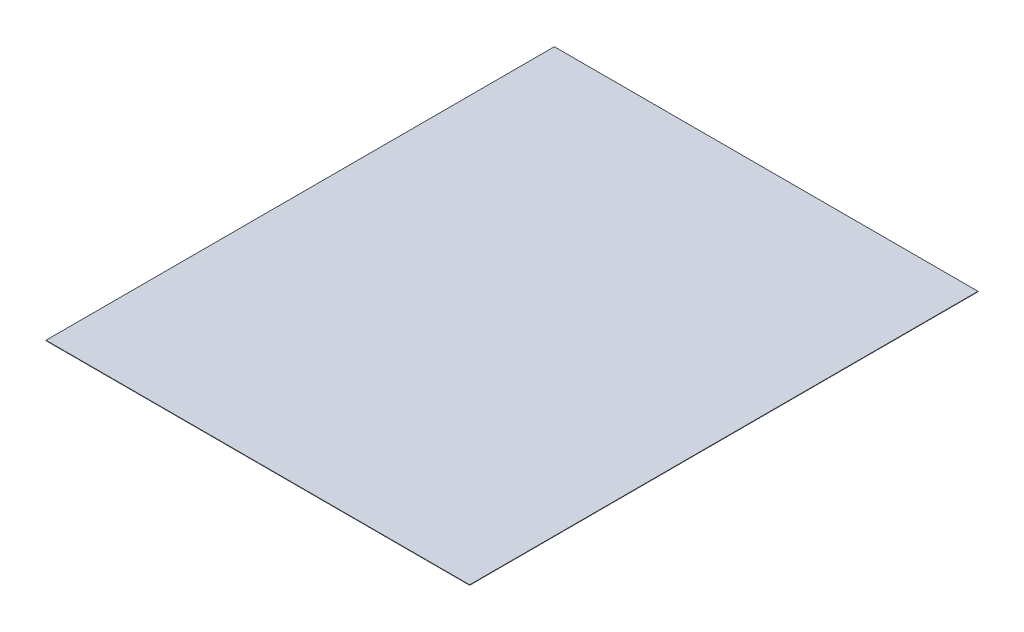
ISO-10303-21;
HEADER;
FILE_DESCRIPTION(('STEP AP214'),'2;1');
FILE_NAME('part.step','',(''),(''),'','','');
FILE_SCHEMA(('AUTOMOTIVE_DESIGN { 1 0 10303 214 1 1 1 1 }'));
ENDSEC;
DATA;
#1=APPLICATION_CONTEXT('core data for automotive mechanical design processes');
#2=APPLICATION_PROTOCOL_DEFINITION('international standard','automotive_design',2000,#1);
#3=PRODUCT_CONTEXT('',#1,'mechanical');
#4=PRODUCT('Part','Part','',(#3));
#5=PRODUCT_RELATED_PRODUCT_CATEGORY('part','',(#4));
#6=PRODUCT_DEFINITION_FORMATION('','',#4);
#7=PRODUCT_DEFINITION_CONTEXT('part definition',#1,'design');
#8=PRODUCT_DEFINITION('design','',#6,#7);
#9=PRODUCT_DEFINITION_SHAPE('','',#8);
#10=(LENGTH_UNIT() NAMED_UNIT(*) SI_UNIT(.MILLI.,.METRE.));
#11=(NAMED_UNIT(*) PLANE_ANGLE_UNIT() SI_UNIT($,.RADIAN.));
#12=(NAMED_UNIT(*) SI_UNIT($,.STERADIAN.) SOLID_ANGLE_UNIT());
#13=UNCERTAINTY_MEASURE_WITH_UNIT(LENGTH_MEASURE(1.E-05),#10,'distance_accuracy_value','');
#14=(GEOMETRIC_REPRESENTATION_CONTEXT(3) GLOBAL_UNCERTAINTY_ASSIGNED_CONTEXT((#13)) GLOBAL_UNIT_ASSIGNED_CONTEXT((#10,
#11,#12)) REPRESENTATION_CONTEXT('',''));
#15=CARTESIAN_POINT('',(0.,0.,0.));
#16=DIRECTION('',(0.,0.,1.));
#17=DIRECTION('',(1.,0.,0.));
#18=AXIS2_PLACEMENT_3D('',#15,#16,#17);
#19=CARTESIAN_POINT('',(12700.,25.4,15240.));
#20=DIRECTION('',(-1.,0.,0.));
#21=DIRECTION('',(0.,0.,1.));
#22=AXIS2_PLACEMENT_3D('',#19,#20,#21);
#23=PLANE('',#22);
#24=DIRECTION('',(0.,0.,-1.));
#25=VECTOR('',#24,1.);
#26=CARTESIAN_POINT('',(12700.,0.,15240.));
#27=LINE('',#26,#25);
#28=CARTESIAN_POINT('',(12700.,0.,15240.));
#29=VERTEX_POINT('',#28);
#30=CARTESIAN_POINT('',(12700.,0.,-15240.));
#31=VERTEX_POINT('',#30);
#32=EDGE_CURVE('E97',#29,#31,#27,.T.);
#33=ORIENTED_EDGE('',*,*,#32,.T.);
#34=DIRECTION('',(0.,-1.,0.));
#35=VECTOR('',#34,1.);
#36=CARTESIAN_POINT('',(12700.,25.4,-15240.));
#37=LINE('',#36,#35);
#38=CARTESIAN_POINT('',(12700.,25.4,-15240.));
#39=VERTEX_POINT('',#38);
#40=EDGE_CURVE('E11',#39,#31,#37,.T.);
#41=ORIENTED_EDGE('',*,*,#40,.F.);
#42=DIRECTION('',(0.,0.,-1.));
#43=VECTOR('',#42,1.);
#44=CARTESIAN_POINT('',(12700.,25.4,15240.));
#45=LINE('',#44,#43);
#46=CARTESIAN_POINT('',(12700.,25.4,15240.));
#47=VERTEX_POINT('',#46);
#48=EDGE_CURVE('E85',#47,#39,#45,.T.);
#49=ORIENTED_EDGE('',*,*,#48,.F.);
#50=DIRECTION('',(0.,-1.,0.));
#51=VECTOR('',#50,1.);
#52=CARTESIAN_POINT('',(12700.,25.4,15240.));
#53=LINE('',#52,#51);
#54=EDGE_CURVE('E93',#47,#29,#53,.T.);
#55=ORIENTED_EDGE('',*,*,#54,.T.);
#56=EDGE_LOOP('',(#33,#41,#49,#55));
#57=FACE_BOUND('',#56,.T.);
#58=ADVANCED_FACE('F34',(#57),#23,.F.);
#59=CARTESIAN_POINT('',(-12700.,25.4,-15240.));
#60=DIRECTION('',(0.,0.,1.));
#61=DIRECTION('',(1.,0.,0.));
#62=AXIS2_PLACEMENT_3D('',#59,#60,#61);
#63=PLANE('',#62);
#64=DIRECTION('',(-1.,0.,0.));
#65=VECTOR('',#64,1.);
#66=CARTESIAN_POINT('',(-12700.,0.,-15240.));
#67=LINE('',#66,#65);
#68=CARTESIAN_POINT('',(-12700.,0.,-15240.));
#69=VERTEX_POINT('',#68);
#70=EDGE_CURVE('E89',#31,#69,#67,.T.);
#71=ORIENTED_EDGE('',*,*,#70,.T.);
#72=DIRECTION('',(0.,-1.,0.));
#73=VECTOR('',#72,1.);
#74=CARTESIAN_POINT('',(-12700.,25.4,-15240.));
#75=LINE('',#74,#73);
#76=CARTESIAN_POINT('',(-12700.,25.4,-15240.));
#77=VERTEX_POINT('',#76);
#78=EDGE_CURVE('E42',#77,#69,#75,.T.);
#79=ORIENTED_EDGE('',*,*,#78,.F.);
#80=DIRECTION('',(-1.,0.,0.));
#81=VECTOR('',#80,1.);
#82=CARTESIAN_POINT('',(-12700.,25.4,-15240.));
#83=LINE('',#82,#81);
#84=EDGE_CURVE('E80',#39,#77,#83,.T.);
#85=ORIENTED_EDGE('',*,*,#84,.F.);
#86=ORIENTED_EDGE('',*,*,#40,.T.);
#87=EDGE_LOOP('',(#71,#79,#85,#86));
#88=FACE_BOUND('',#87,.T.);
#89=ADVANCED_FACE('F88',(#88),#63,.F.);
#90=CARTESIAN_POINT('',(-12700.,25.4,15240.));
#91=DIRECTION('',(1.,0.,0.));
#92=DIRECTION('',(0.,0.,-1.));
#93=AXIS2_PLACEMENT_3D('',#90,#91,#92);
#94=PLANE('',#93);
#95=DIRECTION('',(0.,0.,1.));
#96=VECTOR('',#95,1.);
#97=CARTESIAN_POINT('',(-12700.,0.,15240.));
#98=LINE('',#97,#96);
#99=CARTESIAN_POINT('',(-12700.,0.,15240.));
#100=VERTEX_POINT('',#99);
#101=EDGE_CURVE('E67',#69,#100,#98,.T.);
#102=ORIENTED_EDGE('',*,*,#101,.T.);
#103=DIRECTION('',(0.,-1.,0.));
#104=VECTOR('',#103,1.);
#105=CARTESIAN_POINT('',(-12700.,25.4,15240.));
#106=LINE('',#105,#104);
#107=CARTESIAN_POINT('',(-12700.,25.4,15240.));
#108=VERTEX_POINT('',#107);
#109=EDGE_CURVE('E90',#108,#100,#106,.T.);
#110=ORIENTED_EDGE('',*,*,#109,.F.);
#111=DIRECTION('',(0.,0.,1.));
#112=VECTOR('',#111,1.);
#113=CARTESIAN_POINT('',(-12700.,25.4,15240.));
#114=LINE('',#113,#112);
#115=EDGE_CURVE('E83',#77,#108,#114,.T.);
#116=ORIENTED_EDGE('',*,*,#115,.F.);
#117=ORIENTED_EDGE('',*,*,#78,.T.);
#118=EDGE_LOOP('',(#102,#110,#116,#117));
#119=FACE_BOUND('',#118,.T.);
#120=ADVANCED_FACE('F91',(#119),#94,.F.);
#121=CARTESIAN_POINT('',(-12700.,25.4,15240.));
#122=DIRECTION('',(0.,0.,-1.));
#123=DIRECTION('',(-1.,0.,0.));
#124=AXIS2_PLACEMENT_3D('',#121,#122,#123);
#125=PLANE('',#124);
#126=DIRECTION('',(1.,0.,0.));
#127=VECTOR('',#126,1.);
#128=CARTESIAN_POINT('',(-12700.,0.,15240.));
#129=LINE('',#128,#127);
#130=EDGE_CURVE('E73',#100,#29,#129,.T.);
#131=ORIENTED_EDGE('',*,*,#130,.T.);
#132=ORIENTED_EDGE('',*,*,#54,.F.);
#133=DIRECTION('',(1.,0.,0.));
#134=VECTOR('',#133,1.);
#135=CARTESIAN_POINT('',(-12700.,25.4,15240.));
#136=LINE('',#135,#134);
#137=EDGE_CURVE('E50',#108,#47,#136,.T.);
#138=ORIENTED_EDGE('',*,*,#137,.F.);
#139=ORIENTED_EDGE('',*,*,#109,.T.);
#140=EDGE_LOOP('',(#131,#132,#138,#139));
#141=FACE_BOUND('',#140,.T.);
#142=ADVANCED_FACE('F104',(#141),#125,.F.);
#143=CARTESIAN_POINT('',(12700.,25.4,-15240.));
#144=DIRECTION('',(0.,-1.,0.));
#145=DIRECTION('',(0.,0.,-1.));
#146=AXIS2_PLACEMENT_3D('',#143,#144,#145);
#147=PLANE('',#146);
#148=ORIENTED_EDGE('',*,*,#48,.T.);
#149=ORIENTED_EDGE('',*,*,#84,.T.);
#150=ORIENTED_EDGE('',*,*,#115,.T.);
#151=ORIENTED_EDGE('',*,*,#137,.T.);
#152=EDGE_LOOP('',(#148,#149,#150,#151));
#153=FACE_BOUND('',#152,.T.);
#154=ADVANCED_FACE('F81',(#153),#147,.F.);
#155=CARTESIAN_POINT('',(12700.,0.,-15240.));
#156=DIRECTION('',(0.,-1.,0.));
#157=DIRECTION('',(0.,0.,-1.));
#158=AXIS2_PLACEMENT_3D('',#155,#156,#157);
#159=PLANE('',#158);
#160=ORIENTED_EDGE('',*,*,#32,.F.);
#161=ORIENTED_EDGE('',*,*,#130,.F.);
#162=ORIENTED_EDGE('',*,*,#101,.F.);
#163=ORIENTED_EDGE('',*,*,#70,.F.);
#164=EDGE_LOOP('',(#160,#161,#162,#163));
#165=FACE_BOUND('',#164,.T.);
#166=ADVANCED_FACE('F107',(#165),#159,.T.);
#167=CLOSED_SHELL('',(#58,#89,#120,#142,#154,#166));
#168=MANIFOLD_SOLID_BREP('B2',#167);
#169=ADVANCED_BREP_SHAPE_REPRESENTATION('',(#18,#168),#14);
#170=SHAPE_DEFINITION_REPRESENTATION(#9,#169);
ENDSEC;
END-ISO-10303-21;
